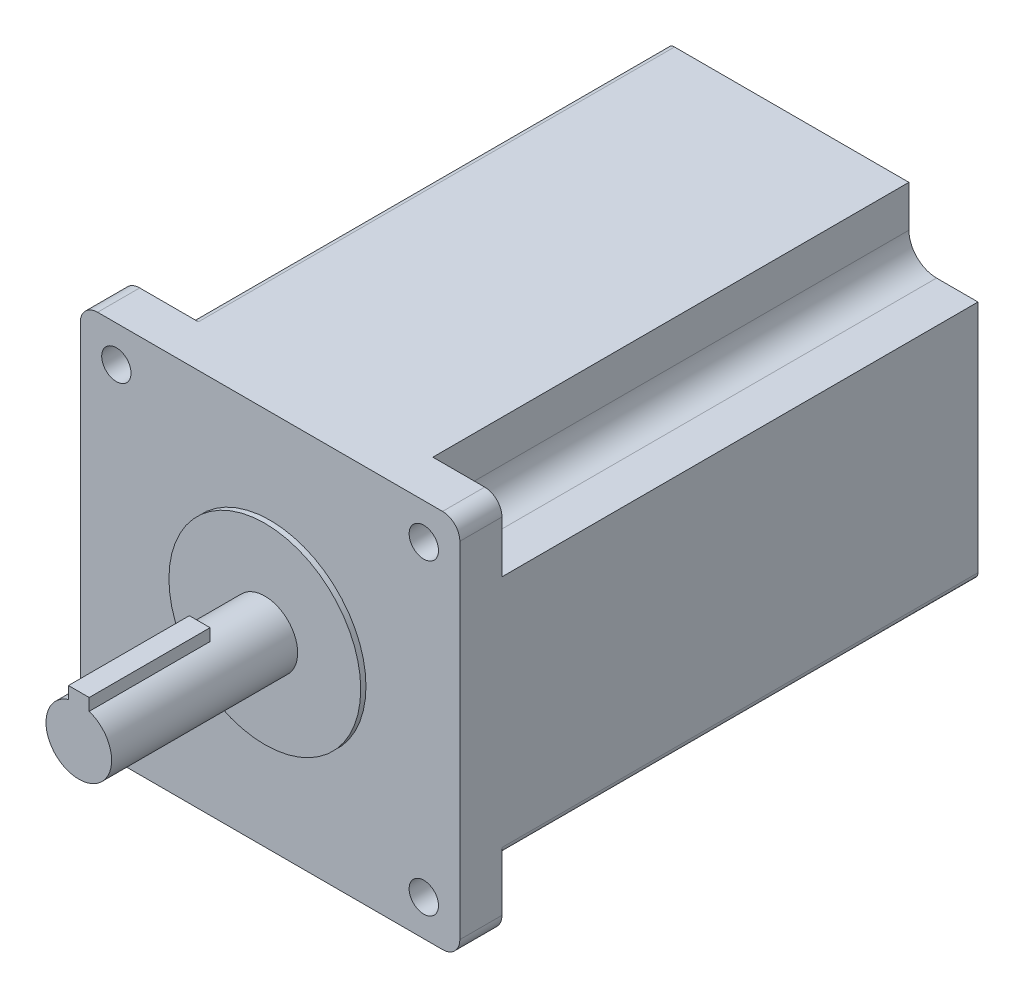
from build123d import *

# Parameters (mm, degrees)
SKETCH_1_W          = 109.86
SKETCH_1_H          = 109.86
EXTRUDE_1_DEPTH     = 150
SKETCH_2_W          = 20
SKETCH_2_H          = 20
CUT_EXTRUDE_2_DEPTH = 137.81
SKETCH_5_R          = 27.76
EXTRUDE_3_DEPTH     = 1.52
SKETCH_6_R          = 9.5
EXTRUDE_4_DEPTH     = 53.85
SKETCH_7_W          = 6
SKETCH_7_H          = 6
EXTRUDE_5_DEPTH     = 35
FILLET_1_R          = 5
FILLET_2_R          = 2
FILLET_3_R          = 8
SKETCH_8_R          = 4.25
CUT_EXTRUDE_6_DEPTH = 194.099603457


with BuildPart() as part:
    # Sketch 1 → Extrude 1 (new body)
    with BuildSketch(Plane.XY):
        with Locations((29.026969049, -33.039791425)):
            Rectangle(SKETCH_1_W, SKETCH_1_H)
    extrude(amount=EXTRUDE_1_DEPTH)

    # Sketch 2 → Cut-Extrude 2 (cut)
    with BuildSketch(Plane(origin=(0, 0, 0), x_dir=(-1, 0, 0), z_dir=(0, 0, -1))):
        with Locations((-73.956969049, 11.890208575)):
            Rectangle(SKETCH_2_W, SKETCH_2_H)
        with Locations((15.903030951, 11.890208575)):
            Rectangle(SKETCH_2_W, SKETCH_2_H)
        with Locations((15.903030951, -77.969791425)):
            Rectangle(SKETCH_2_W, SKETCH_2_H)
        with Locations((-73.956969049, -77.969791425)):
            Rectangle(SKETCH_2_W, SKETCH_2_H)
    extrude(amount=-CUT_EXTRUDE_2_DEPTH, mode=Mode.SUBTRACT)

    # Sketch 5 → Extrude 3 (add)
    with BuildSketch(Plane.XY.offset(150)):
        with Locations((29.026969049, -33.039791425)):
            Circle(SKETCH_5_R)
    extrude(amount=EXTRUDE_3_DEPTH)

    # Sketch 6 → Extrude 4 (add)
    with BuildSketch(Plane.XY.offset(151.52)):
        with Locations(Location((29.026969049, -33.039791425, 0), (0, 0, 180))):
            Circle(SKETCH_6_R)
    extrude(amount=EXTRUDE_4_DEPTH)

    # Sketch 7 → Extrude 5 (add)
    with BuildSketch(Plane.XY.offset(205.37)):
        with Locations((29.026969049, -23.539791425)):
            Rectangle(SKETCH_7_W, SKETCH_7_H)
    extrude(amount=-EXTRUDE_5_DEPTH)

    # Fillet 1
    fillet_1_edges = [part.edges().sort_by_distance(p)[0] for p in [
        (-25.903030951, 21.890208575, 143.905),
        (83.956969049, 21.890208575, 143.905),
        (83.956969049, -87.969791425, 143.905),
        (-25.903030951, -87.969791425, 143.905),
    ]]
    fillet(fillet_1_edges, radius=FILLET_1_R)

    # Fillet 2
    fillet_2_edges = [part.edges().sort_by_distance(p)[0] for p in [
        (-25.903030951, 1.890208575, 68.905),
        (-5.903030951, 21.890208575, 68.905),
        (-25.903030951, -67.969791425, 68.905),
        (-5.903030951, -87.969791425, 68.905),
        (83.956969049, -67.969791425, 68.905),
        (63.956969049, -87.969791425, 68.905),
    ]]
    fillet(fillet_2_edges, radius=FILLET_2_R)

    # Fillet 3
    fillet_3_edges = [part.edges().sort_by_distance(p)[0] for p in [
        (63.956969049, 1.890208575, 68.905),
        (-5.903030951, 1.890208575, 68.905),
        (-5.903030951, -67.969791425, 68.905),
        (63.956969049, -67.969791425, 68.905),
    ]]
    fillet(fillet_3_edges, radius=FILLET_3_R)

    # Sketch 8 → Cut-Extrude 6 (cut, through all)
    with BuildSketch(Plane.XY.offset(150)):
        with Locations((-15.473030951, 11.460208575)):
            Circle(SKETCH_8_R)
        with Locations((73.526969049, 11.460208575)):
            Circle(SKETCH_8_R)
        with Locations((-15.473030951, -77.539791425)):
            Circle(SKETCH_8_R)
        with Locations((73.526969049, -77.539791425)):
            Circle(SKETCH_8_R)
    extrude(amount=-CUT_EXTRUDE_6_DEPTH, mode=Mode.SUBTRACT)


solid = part.part
